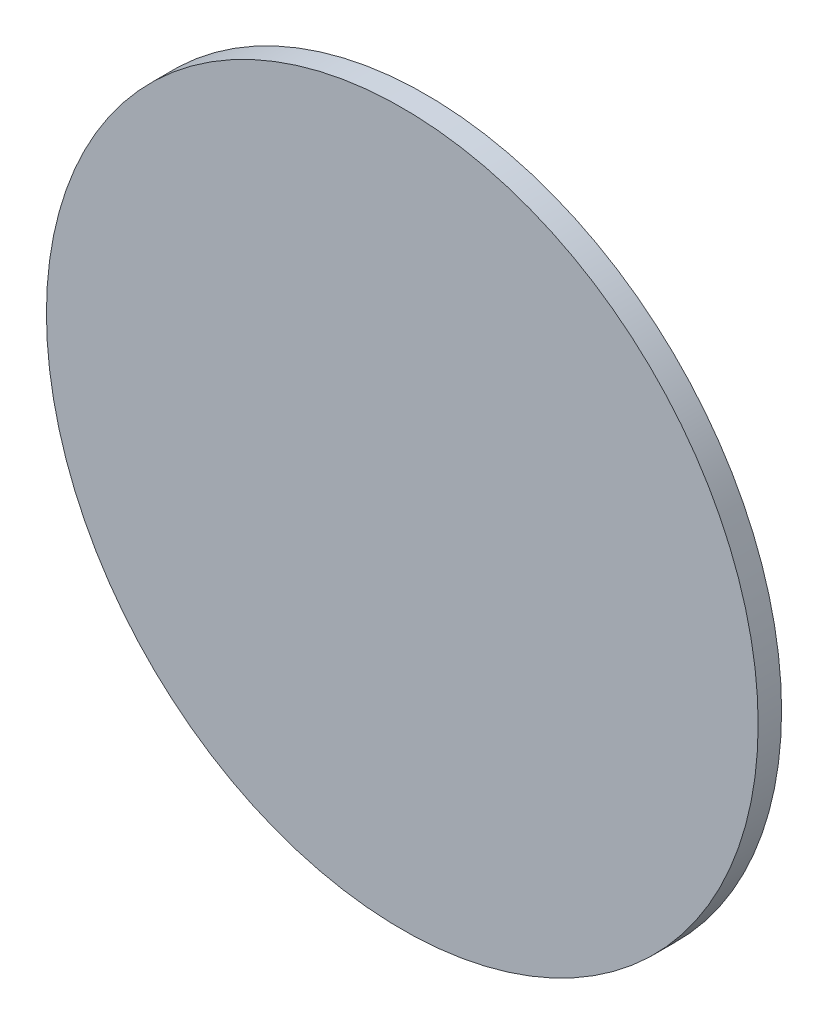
ISO-10303-21;
HEADER;
FILE_DESCRIPTION(('STEP AP214'),'2;1');
FILE_NAME('part.step','',(''),(''),'','','');
FILE_SCHEMA(('AUTOMOTIVE_DESIGN { 1 0 10303 214 1 1 1 1 }'));
ENDSEC;
DATA;
#1=APPLICATION_CONTEXT('core data for automotive mechanical design processes');
#2=APPLICATION_PROTOCOL_DEFINITION('international standard','automotive_design',2000,#1);
#3=PRODUCT_CONTEXT('',#1,'mechanical');
#4=PRODUCT('Part','Part','',(#3));
#5=PRODUCT_RELATED_PRODUCT_CATEGORY('part','',(#4));
#6=PRODUCT_DEFINITION_FORMATION('','',#4);
#7=PRODUCT_DEFINITION_CONTEXT('part definition',#1,'design');
#8=PRODUCT_DEFINITION('design','',#6,#7);
#9=PRODUCT_DEFINITION_SHAPE('','',#8);
#10=(LENGTH_UNIT() NAMED_UNIT(*) SI_UNIT(.MILLI.,.METRE.));
#11=(NAMED_UNIT(*) PLANE_ANGLE_UNIT() SI_UNIT($,.RADIAN.));
#12=(NAMED_UNIT(*) SI_UNIT($,.STERADIAN.) SOLID_ANGLE_UNIT());
#13=UNCERTAINTY_MEASURE_WITH_UNIT(LENGTH_MEASURE(1.E-05),#10,'distance_accuracy_value','');
#14=(GEOMETRIC_REPRESENTATION_CONTEXT(3) GLOBAL_UNCERTAINTY_ASSIGNED_CONTEXT((#13)) GLOBAL_UNIT_ASSIGNED_CONTEXT((#10,
#11,#12)) REPRESENTATION_CONTEXT('',''));
#15=CARTESIAN_POINT('',(0.,0.,0.));
#16=DIRECTION('',(0.,0.,1.));
#17=DIRECTION('',(1.,0.,0.));
#18=AXIS2_PLACEMENT_3D('',#15,#16,#17);
#19=CARTESIAN_POINT('',(0.,0.,5.));
#20=DIRECTION('',(0.,0.,-1.));
#21=DIRECTION('',(-1.,0.,0.));
#22=AXIS2_PLACEMENT_3D('',#19,#20,#21);
#23=CYLINDRICAL_SURFACE('',#22,76.);
#24=CARTESIAN_POINT('',(0.,0.,5.));
#25=DIRECTION('',(0.,0.,1.));
#26=DIRECTION('',(1.,0.,0.));
#27=AXIS2_PLACEMENT_3D('',#24,#25,#26);
#28=CIRCLE('',#27,76.);
#29=CARTESIAN_POINT('',(76.,0.,5.));
#30=VERTEX_POINT('',#29);
#31=EDGE_CURVE('E10',#30,#30,#28,.T.);
#32=ORIENTED_EDGE('',*,*,#31,.F.);
#33=EDGE_LOOP('',(#32));
#34=FACE_BOUND('',#33,.T.);
#35=CARTESIAN_POINT('',(0.,0.,0.));
#36=DIRECTION('',(0.,0.,1.));
#37=DIRECTION('',(1.,0.,0.));
#38=AXIS2_PLACEMENT_3D('',#35,#36,#37);
#39=CIRCLE('',#38,76.);
#40=CARTESIAN_POINT('',(76.,0.,0.));
#41=VERTEX_POINT('',#40);
#42=EDGE_CURVE('E40',#41,#41,#39,.T.);
#43=ORIENTED_EDGE('',*,*,#42,.T.);
#44=EDGE_LOOP('',(#43));
#45=FACE_BOUND('',#44,.T.);
#46=ADVANCED_FACE('F37',(#34,#45),#23,.T.);
#47=CARTESIAN_POINT('',(0.,0.,5.));
#48=DIRECTION('',(0.,0.,1.));
#49=DIRECTION('',(1.,0.,0.));
#50=AXIS2_PLACEMENT_3D('',#47,#48,#49);
#51=PLANE('',#50);
#52=ORIENTED_EDGE('',*,*,#31,.T.);
#53=EDGE_LOOP('',(#52));
#54=FACE_BOUND('',#53,.T.);
#55=ADVANCED_FACE('F52',(#54),#51,.T.);
#56=CARTESIAN_POINT('',(0.,0.,0.));
#57=DIRECTION('',(0.,0.,1.));
#58=DIRECTION('',(1.,0.,0.));
#59=AXIS2_PLACEMENT_3D('',#56,#57,#58);
#60=PLANE('',#59);
#61=ORIENTED_EDGE('',*,*,#42,.F.);
#62=EDGE_LOOP('',(#61));
#63=FACE_BOUND('',#62,.T.);
#64=ADVANCED_FACE('F50',(#63),#60,.F.);
#65=CLOSED_SHELL('',(#46,#55,#64));
#66=MANIFOLD_SOLID_BREP('B2',#65);
#67=ADVANCED_BREP_SHAPE_REPRESENTATION('',(#18,#66),#14);
#68=SHAPE_DEFINITION_REPRESENTATION(#9,#67);
ENDSEC;
END-ISO-10303-21;
